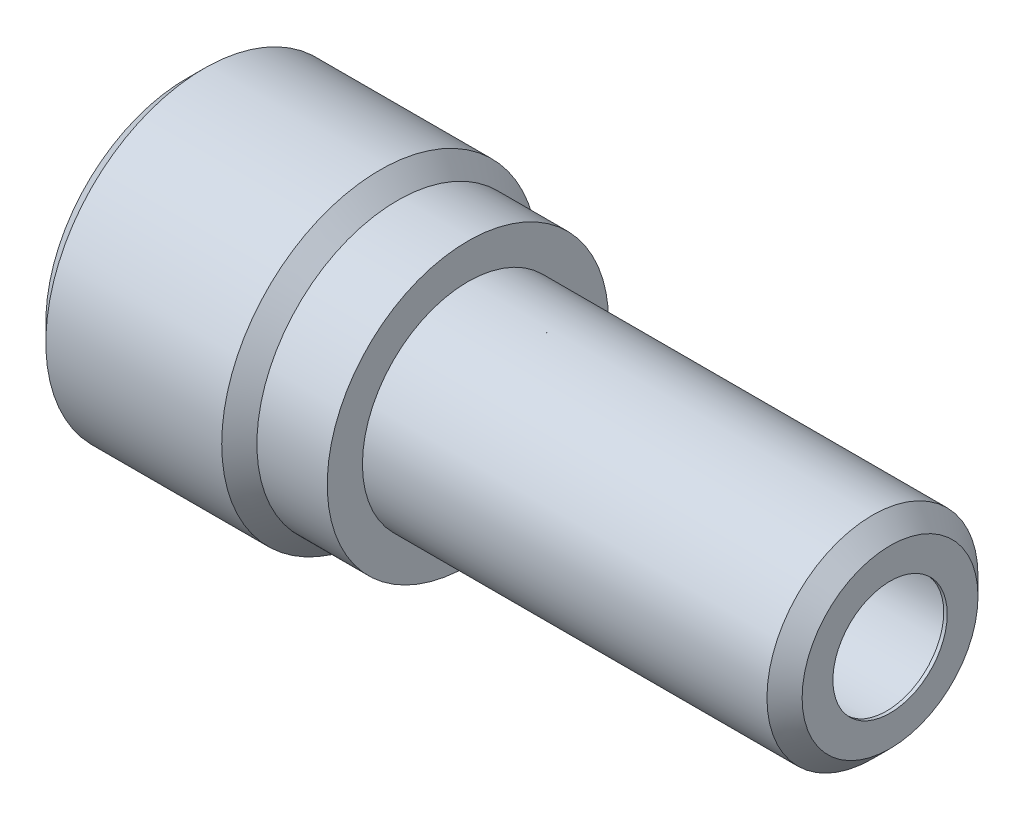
ISO-10303-21;
HEADER;
FILE_DESCRIPTION(('STEP AP214'),'2;1');
FILE_NAME('part.step','',(''),(''),'','','');
FILE_SCHEMA(('AUTOMOTIVE_DESIGN { 1 0 10303 214 1 1 1 1 }'));
ENDSEC;
DATA;
#1=APPLICATION_CONTEXT('core data for automotive mechanical design processes');
#2=APPLICATION_PROTOCOL_DEFINITION('international standard','automotive_design',2000,#1);
#3=PRODUCT_CONTEXT('',#1,'mechanical');
#4=PRODUCT('Part','Part','',(#3));
#5=PRODUCT_RELATED_PRODUCT_CATEGORY('part','',(#4));
#6=PRODUCT_DEFINITION_FORMATION('','',#4);
#7=PRODUCT_DEFINITION_CONTEXT('part definition',#1,'design');
#8=PRODUCT_DEFINITION('design','',#6,#7);
#9=PRODUCT_DEFINITION_SHAPE('','',#8);
#10=(LENGTH_UNIT() NAMED_UNIT(*) SI_UNIT(.MILLI.,.METRE.));
#11=(NAMED_UNIT(*) PLANE_ANGLE_UNIT() SI_UNIT($,.RADIAN.));
#12=(NAMED_UNIT(*) SI_UNIT($,.STERADIAN.) SOLID_ANGLE_UNIT());
#13=UNCERTAINTY_MEASURE_WITH_UNIT(LENGTH_MEASURE(1.E-05),#10,'distance_accuracy_value','');
#14=(GEOMETRIC_REPRESENTATION_CONTEXT(3) GLOBAL_UNCERTAINTY_ASSIGNED_CONTEXT((#13)) GLOBAL_UNIT_ASSIGNED_CONTEXT((#10,
#11,#12)) REPRESENTATION_CONTEXT('',''));
#15=CARTESIAN_POINT('',(0.,0.,0.));
#16=DIRECTION('',(0.,0.,1.));
#17=DIRECTION('',(1.,0.,0.));
#18=AXIS2_PLACEMENT_3D('',#15,#16,#17);
#19=CARTESIAN_POINT('',(-2.,0.,0.));
#20=DIRECTION('',(1.,0.,0.));
#21=DIRECTION('',(0.,0.,-1.));
#22=AXIS2_PLACEMENT_3D('',#19,#20,#21);
#23=CYLINDRICAL_SURFACE('',#22,4.25);
#24=CARTESIAN_POINT('',(0.,0.,0.));
#25=DIRECTION('',(1.,0.,0.));
#26=DIRECTION('',(0.,0.,-1.));
#27=AXIS2_PLACEMENT_3D('',#24,#25,#26);
#28=CIRCLE('',#27,4.25);
#29=CARTESIAN_POINT('',(0.,0.,-4.25));
#30=VERTEX_POINT('',#29);
#31=EDGE_CURVE('E17',#30,#30,#28,.F.);
#32=ORIENTED_EDGE('',*,*,#31,.T.);
#33=EDGE_LOOP('',(#32));
#34=FACE_BOUND('',#33,.T.);
#35=CARTESIAN_POINT('',(13.9999999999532,0.,0.));
#36=DIRECTION('',(-1.,0.,0.));
#37=DIRECTION('',(0.,0.,1.));
#38=AXIS2_PLACEMENT_3D('',#35,#36,#37);
#39=CIRCLE('',#38,4.2499999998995);
#40=CARTESIAN_POINT('',(13.9999999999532,0.,4.2499999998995));
#41=VERTEX_POINT('',#40);
#42=EDGE_CURVE('E49',#41,#41,#39,.F.);
#43=ORIENTED_EDGE('',*,*,#42,.T.);
#44=EDGE_LOOP('',(#43));
#45=FACE_BOUND('',#44,.T.);
#46=ADVANCED_FACE('F14',(#34,#45),#23,.F.);
#47=CARTESIAN_POINT('',(0.,0.,0.));
#48=DIRECTION('',(1.,0.,0.));
#49=DIRECTION('',(0.,0.,-1.));
#50=AXIS2_PLACEMENT_3D('',#47,#48,#49);
#51=PLANE('',#50);
#52=CARTESIAN_POINT('',(0.,0.,0.));
#53=DIRECTION('',(1.,0.,0.));
#54=DIRECTION('',(0.,0.,-1.));
#55=AXIS2_PLACEMENT_3D('',#52,#53,#54);
#56=CIRCLE('',#55,8.00000000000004);
#57=CARTESIAN_POINT('',(0.,0.,-8.00000000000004));
#58=VERTEX_POINT('',#57);
#59=EDGE_CURVE('E48',#58,#58,#56,.T.);
#60=ORIENTED_EDGE('',*,*,#59,.F.);
#61=EDGE_LOOP('',(#60));
#62=FACE_BOUND('',#61,.T.);
#63=ORIENTED_EDGE('',*,*,#31,.F.);
#64=EDGE_LOOP('',(#63));
#65=FACE_BOUND('',#64,.T.);
#66=ADVANCED_FACE('F64',(#62,#65),#51,.F.);
#67=CARTESIAN_POINT('',(13.9999999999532,0.,0.));
#68=DIRECTION('',(-1.,0.,0.));
#69=DIRECTION('',(0.,0.,1.));
#70=AXIS2_PLACEMENT_3D('',#67,#68,#69);
#71=CONICAL_SURFACE('',#70,4.2499999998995,1.02974425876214);
#72=CARTESIAN_POINT('',(14.12017212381,0.,0.));
#73=DIRECTION('',(1.,0.,0.));
#74=DIRECTION('',(0.,0.,-1.));
#75=AXIS2_PLACEMENT_3D('',#72,#73,#74);
#76=CIRCLE('',#75,4.05);
#77=CARTESIAN_POINT('',(14.12017212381,0.,-4.05));
#78=VERTEX_POINT('',#77);
#79=EDGE_CURVE('E45',#78,#78,#76,.T.);
#80=ORIENTED_EDGE('',*,*,#79,.T.);
#81=EDGE_LOOP('',(#80));
#82=FACE_BOUND('',#81,.T.);
#83=ORIENTED_EDGE('',*,*,#42,.F.);
#84=EDGE_LOOP('',(#83));
#85=FACE_BOUND('',#84,.T.);
#86=ADVANCED_FACE('F67',(#82,#85),#71,.F.);
#87=CARTESIAN_POINT('',(1.,0.,0.));
#88=DIRECTION('',(1.,0.,0.));
#89=DIRECTION('',(0.,0.,-1.));
#90=AXIS2_PLACEMENT_3D('',#87,#88,#89);
#91=CONICAL_SURFACE('',#90,8.99999999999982,0.7853981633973);
#92=ORIENTED_EDGE('',*,*,#59,.T.);
#93=EDGE_LOOP('',(#92));
#94=FACE_BOUND('',#93,.T.);
#95=CARTESIAN_POINT('',(1.,0.,0.));
#96=DIRECTION('',(1.,0.,0.));
#97=DIRECTION('',(0.,0.,-1.));
#98=AXIS2_PLACEMENT_3D('',#95,#96,#97);
#99=CIRCLE('',#98,9.);
#100=CARTESIAN_POINT('',(1.,0.,-9.));
#101=VERTEX_POINT('',#100);
#102=EDGE_CURVE('E42',#101,#101,#99,.T.);
#103=ORIENTED_EDGE('',*,*,#102,.F.);
#104=EDGE_LOOP('',(#103));
#105=FACE_BOUND('',#104,.T.);
#106=ADVANCED_FACE('F61',(#94,#105),#91,.T.);
#107=CARTESIAN_POINT('',(-2.,0.,0.));
#108=DIRECTION('',(1.,0.,0.));
#109=DIRECTION('',(0.,0.,-1.));
#110=AXIS2_PLACEMENT_3D('',#107,#108,#109);
#111=CYLINDRICAL_SURFACE('',#110,4.05);
#112=ORIENTED_EDGE('',*,*,#79,.F.);
#113=EDGE_LOOP('',(#112));
#114=FACE_BOUND('',#113,.T.);
#115=CARTESIAN_POINT('',(39.319311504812,0.,0.));
#116=DIRECTION('',(-1.,0.,0.));
#117=DIRECTION('',(0.,0.,1.));
#118=AXIS2_PLACEMENT_3D('',#115,#116,#117);
#119=CIRCLE('',#118,4.05000000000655);
#120=CARTESIAN_POINT('',(39.319311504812,0.,4.05000000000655));
#121=VERTEX_POINT('',#120);
#122=EDGE_CURVE('E39',#121,#121,#119,.F.);
#123=ORIENTED_EDGE('',*,*,#122,.T.);
#124=EDGE_LOOP('',(#123));
#125=FACE_BOUND('',#124,.T.);
#126=ADVANCED_FACE('F82',(#114,#125),#111,.F.);
#127=CARTESIAN_POINT('',(-2.,0.,0.));
#128=DIRECTION('',(1.,0.,0.));
#129=DIRECTION('',(0.,0.,-1.));
#130=AXIS2_PLACEMENT_3D('',#127,#128,#129);
#131=CYLINDRICAL_SURFACE('',#130,9.);
#132=ORIENTED_EDGE('',*,*,#102,.T.);
#133=EDGE_LOOP('',(#132));
#134=FACE_BOUND('',#133,.T.);
#135=CARTESIAN_POINT('',(10.9999999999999,0.,0.));
#136=DIRECTION('',(-1.,0.,0.));
#137=DIRECTION('',(0.,0.,1.));
#138=AXIS2_PLACEMENT_3D('',#135,#136,#137);
#139=CIRCLE('',#138,8.99999999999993);
#140=CARTESIAN_POINT('',(10.9999999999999,0.,8.99999999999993));
#141=VERTEX_POINT('',#140);
#142=EDGE_CURVE('E36',#141,#141,#139,.F.);
#143=ORIENTED_EDGE('',*,*,#142,.F.);
#144=EDGE_LOOP('',(#143));
#145=FACE_BOUND('',#144,.T.);
#146=ADVANCED_FACE('F118',(#134,#145),#131,.T.);
#147=CARTESIAN_POINT('',(39.319311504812,0.,0.));
#148=DIRECTION('',(-1.,0.,0.));
#149=DIRECTION('',(0.,0.,1.));
#150=AXIS2_PLACEMENT_3D('',#147,#148,#149);
#151=CONICAL_SURFACE('',#150,4.05000000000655,1.02974425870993);
#152=CARTESIAN_POINT('',(39.7999999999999,0.,0.));
#153=DIRECTION('',(1.,0.,0.));
#154=DIRECTION('',(0.,0.,-1.));
#155=AXIS2_PLACEMENT_3D('',#152,#153,#154);
#156=CIRCLE('',#155,3.25);
#157=CARTESIAN_POINT('',(39.7999999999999,0.,-3.25));
#158=VERTEX_POINT('',#157);
#159=EDGE_CURVE('E33',#158,#158,#156,.T.);
#160=ORIENTED_EDGE('',*,*,#159,.T.);
#161=EDGE_LOOP('',(#160));
#162=FACE_BOUND('',#161,.T.);
#163=ORIENTED_EDGE('',*,*,#122,.F.);
#164=EDGE_LOOP('',(#163));
#165=FACE_BOUND('',#164,.T.);
#166=ADVANCED_FACE('F114',(#162,#165),#151,.F.);
#167=CARTESIAN_POINT('',(10.9999999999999,0.,0.));
#168=DIRECTION('',(-1.,0.,0.));
#169=DIRECTION('',(0.,0.,1.));
#170=AXIS2_PLACEMENT_3D('',#167,#168,#169);
#171=CONICAL_SURFACE('',#170,8.99999999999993,0.785398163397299);
#172=CARTESIAN_POINT('',(12.,0.,0.));
#173=DIRECTION('',(1.,0.,0.));
#174=DIRECTION('',(0.,0.,-1.));
#175=AXIS2_PLACEMENT_3D('',#172,#173,#174);
#176=CIRCLE('',#175,8.);
#177=CARTESIAN_POINT('',(12.,0.,-8.));
#178=VERTEX_POINT('',#177);
#179=EDGE_CURVE('E29',#178,#178,#176,.T.);
#180=ORIENTED_EDGE('',*,*,#179,.F.);
#181=EDGE_LOOP('',(#180));
#182=FACE_BOUND('',#181,.T.);
#183=ORIENTED_EDGE('',*,*,#142,.T.);
#184=EDGE_LOOP('',(#183));
#185=FACE_BOUND('',#184,.T.);
#186=ADVANCED_FACE('F110',(#182,#185),#171,.T.);
#187=CARTESIAN_POINT('',(-2.,0.,0.));
#188=DIRECTION('',(1.,0.,0.));
#189=DIRECTION('',(0.,0.,-1.));
#190=AXIS2_PLACEMENT_3D('',#187,#188,#189);
#191=CYLINDRICAL_SURFACE('',#190,3.25);
#192=ORIENTED_EDGE('',*,*,#159,.F.);
#193=EDGE_LOOP('',(#192));
#194=FACE_BOUND('',#193,.T.);
#195=CARTESIAN_POINT('',(40.,0.,0.));
#196=DIRECTION('',(1.,0.,0.));
#197=DIRECTION('',(0.,0.,-1.));
#198=AXIS2_PLACEMENT_3D('',#195,#196,#197);
#199=CIRCLE('',#198,3.25);
#200=CARTESIAN_POINT('',(40.,0.,-3.25));
#201=VERTEX_POINT('',#200);
#202=EDGE_CURVE('E32',#201,#201,#199,.F.);
#203=ORIENTED_EDGE('',*,*,#202,.F.);
#204=EDGE_LOOP('',(#203));
#205=FACE_BOUND('',#204,.T.);
#206=ADVANCED_FACE('F106',(#194,#205),#191,.F.);
#207=CARTESIAN_POINT('',(-2.,0.,0.));
#208=DIRECTION('',(1.,0.,0.));
#209=DIRECTION('',(0.,0.,-1.));
#210=AXIS2_PLACEMENT_3D('',#207,#208,#209);
#211=CYLINDRICAL_SURFACE('',#210,8.);
#212=ORIENTED_EDGE('',*,*,#179,.T.);
#213=EDGE_LOOP('',(#212));
#214=FACE_BOUND('',#213,.T.);
#215=CARTESIAN_POINT('',(16.,0.,0.));
#216=DIRECTION('',(1.,0.,0.));
#217=DIRECTION('',(0.,0.,-1.));
#218=AXIS2_PLACEMENT_3D('',#215,#216,#217);
#219=CIRCLE('',#218,8.);
#220=CARTESIAN_POINT('',(16.,0.,-8.));
#221=VERTEX_POINT('',#220);
#222=EDGE_CURVE('E54',#221,#221,#219,.T.);
#223=ORIENTED_EDGE('',*,*,#222,.F.);
#224=EDGE_LOOP('',(#223));
#225=FACE_BOUND('',#224,.T.);
#226=ADVANCED_FACE('F102',(#214,#225),#211,.T.);
#227=CARTESIAN_POINT('',(40.,0.,0.));
#228=DIRECTION('',(1.,0.,0.));
#229=DIRECTION('',(0.,0.,-1.));
#230=AXIS2_PLACEMENT_3D('',#227,#228,#229);
#231=PLANE('',#230);
#232=CARTESIAN_POINT('',(39.9999999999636,0.,0.));
#233=DIRECTION('',(-1.,0.,0.));
#234=DIRECTION('',(0.,0.,1.));
#235=AXIS2_PLACEMENT_3D('',#232,#233,#234);
#236=CIRCLE('',#235,4.99999999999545);
#237=CARTESIAN_POINT('',(39.9999999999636,0.,4.99999999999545));
#238=VERTEX_POINT('',#237);
#239=EDGE_CURVE('E26',#238,#238,#236,.T.);
#240=ORIENTED_EDGE('',*,*,#239,.F.);
#241=EDGE_LOOP('',(#240));
#242=FACE_BOUND('',#241,.T.);
#243=ORIENTED_EDGE('',*,*,#202,.T.);
#244=EDGE_LOOP('',(#243));
#245=FACE_BOUND('',#244,.T.);
#246=ADVANCED_FACE('F98',(#242,#245),#231,.T.);
#247=CARTESIAN_POINT('',(16.,0.,0.));
#248=DIRECTION('',(1.,0.,0.));
#249=DIRECTION('',(0.,0.,-1.));
#250=AXIS2_PLACEMENT_3D('',#247,#248,#249);
#251=PLANE('',#250);
#252=ORIENTED_EDGE('',*,*,#222,.T.);
#253=EDGE_LOOP('',(#252));
#254=FACE_BOUND('',#253,.T.);
#255=CARTESIAN_POINT('',(16.,0.,0.));
#256=DIRECTION('',(1.,0.,0.));
#257=DIRECTION('',(0.,0.,-1.));
#258=AXIS2_PLACEMENT_3D('',#255,#256,#257);
#259=CIRCLE('',#258,6.);
#260=CARTESIAN_POINT('',(16.,0.,-6.));
#261=VERTEX_POINT('',#260);
#262=EDGE_CURVE('E21',#261,#261,#259,.T.);
#263=ORIENTED_EDGE('',*,*,#262,.F.);
#264=EDGE_LOOP('',(#263));
#265=FACE_BOUND('',#264,.T.);
#266=ADVANCED_FACE('F91',(#254,#265),#251,.T.);
#267=CARTESIAN_POINT('',(39.000000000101,0.,0.));
#268=DIRECTION('',(-1.,0.,0.));
#269=DIRECTION('',(0.,0.,1.));
#270=AXIS2_PLACEMENT_3D('',#267,#268,#269);
#271=CONICAL_SURFACE('',#270,5.99999999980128,0.785398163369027);
#272=CARTESIAN_POINT('',(39.,0.,0.));
#273=DIRECTION('',(1.,0.,0.));
#274=DIRECTION('',(0.,0.,-1.));
#275=AXIS2_PLACEMENT_3D('',#272,#273,#274);
#276=CIRCLE('',#275,6.);
#277=CARTESIAN_POINT('',(39.,0.,-6.));
#278=VERTEX_POINT('',#277);
#279=EDGE_CURVE('E10',#278,#278,#276,.F.);
#280=ORIENTED_EDGE('',*,*,#279,.F.);
#281=EDGE_LOOP('',(#280));
#282=FACE_BOUND('',#281,.T.);
#283=ORIENTED_EDGE('',*,*,#239,.T.);
#284=EDGE_LOOP('',(#283));
#285=FACE_BOUND('',#284,.T.);
#286=ADVANCED_FACE('F86',(#282,#285),#271,.T.);
#287=CARTESIAN_POINT('',(-2.,0.,0.));
#288=DIRECTION('',(1.,0.,0.));
#289=DIRECTION('',(0.,0.,-1.));
#290=AXIS2_PLACEMENT_3D('',#287,#288,#289);
#291=CYLINDRICAL_SURFACE('',#290,6.);
#292=ORIENTED_EDGE('',*,*,#279,.T.);
#293=EDGE_LOOP('',(#292));
#294=FACE_BOUND('',#293,.T.);
#295=ORIENTED_EDGE('',*,*,#262,.T.);
#296=EDGE_LOOP('',(#295));
#297=FACE_BOUND('',#296,.T.);
#298=ADVANCED_FACE('F84',(#294,#297),#291,.T.);
#299=CLOSED_SHELL('',(#46,#66,#86,#106,#126,#146,#166,#186,#206,#226,#246,#266,#286,#298));
#300=MANIFOLD_SOLID_BREP('B1',#299);
#301=ADVANCED_BREP_SHAPE_REPRESENTATION('',(#18,#300),#14);
#302=SHAPE_DEFINITION_REPRESENTATION(#9,#301);
ENDSEC;
END-ISO-10303-21;
